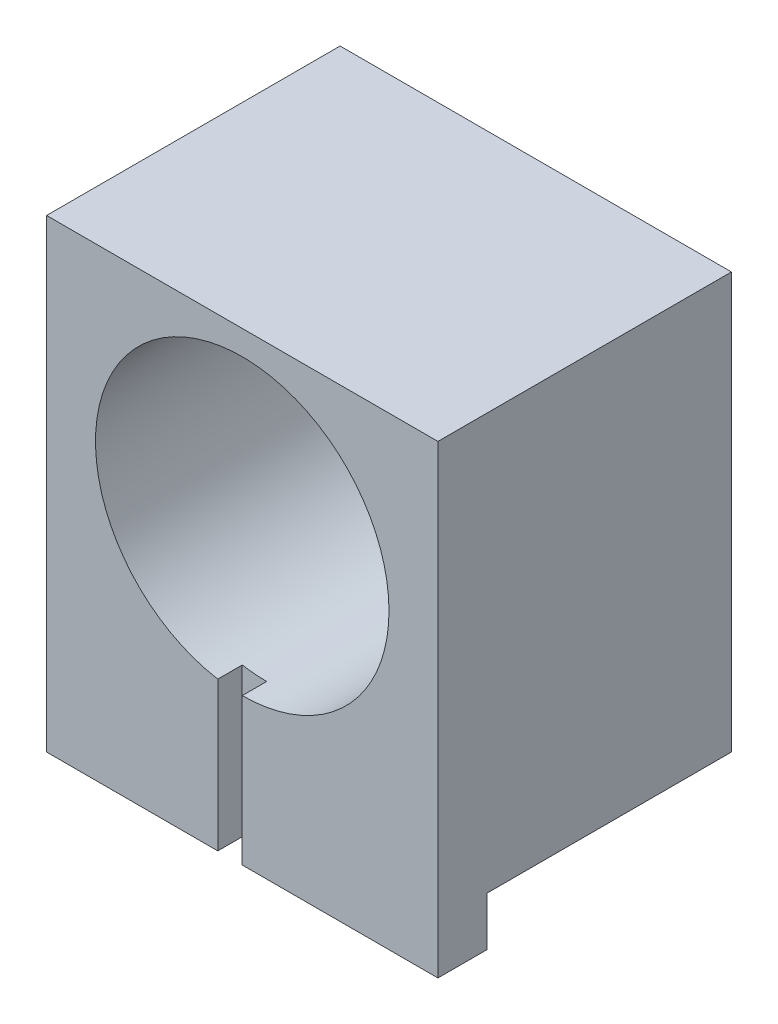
ISO-10303-21;
HEADER;
FILE_DESCRIPTION(('STEP AP214'),'2;1');
FILE_NAME('part.step','',(''),(''),'','','');
FILE_SCHEMA(('AUTOMOTIVE_DESIGN { 1 0 10303 214 1 1 1 1 }'));
ENDSEC;
DATA;
#1=APPLICATION_CONTEXT('core data for automotive mechanical design processes');
#2=APPLICATION_PROTOCOL_DEFINITION('international standard','automotive_design',2000,#1);
#3=PRODUCT_CONTEXT('',#1,'mechanical');
#4=PRODUCT('Part','Part','',(#3));
#5=PRODUCT_RELATED_PRODUCT_CATEGORY('part','',(#4));
#6=PRODUCT_DEFINITION_FORMATION('','',#4);
#7=PRODUCT_DEFINITION_CONTEXT('part definition',#1,'design');
#8=PRODUCT_DEFINITION('design','',#6,#7);
#9=PRODUCT_DEFINITION_SHAPE('','',#8);
#10=(LENGTH_UNIT() NAMED_UNIT(*) SI_UNIT(.MILLI.,.METRE.));
#11=(NAMED_UNIT(*) PLANE_ANGLE_UNIT() SI_UNIT($,.RADIAN.));
#12=(NAMED_UNIT(*) SI_UNIT($,.STERADIAN.) SOLID_ANGLE_UNIT());
#13=UNCERTAINTY_MEASURE_WITH_UNIT(LENGTH_MEASURE(1.E-05),#10,'distance_accuracy_value','');
#14=(GEOMETRIC_REPRESENTATION_CONTEXT(3) GLOBAL_UNCERTAINTY_ASSIGNED_CONTEXT((#13)) GLOBAL_UNIT_ASSIGNED_CONTEXT((#10,
#11,#12)) REPRESENTATION_CONTEXT('',''));
#15=CARTESIAN_POINT('',(0.,0.,0.));
#16=DIRECTION('',(0.,0.,1.));
#17=DIRECTION('',(1.,0.,0.));
#18=AXIS2_PLACEMENT_3D('',#15,#16,#17);
#19=CARTESIAN_POINT('',(0.,0.,60.));
#20=DIRECTION('',(0.,1.,0.));
#21=DIRECTION('',(0.,0.,1.));
#22=AXIS2_PLACEMENT_3D('',#19,#20,#21);
#23=PLANE('',#22);
#24=DIRECTION('',(1.,0.,0.));
#25=VECTOR('',#24,1.);
#26=CARTESIAN_POINT('',(0.,0.,50.));
#27=LINE('',#26,#25);
#28=CARTESIAN_POINT('',(0.,0.,50.));
#29=VERTEX_POINT('',#28);
#30=CARTESIAN_POINT('',(80.,0.,50.));
#31=VERTEX_POINT('',#30);
#32=EDGE_CURVE('E374',#29,#31,#27,.T.);
#33=ORIENTED_EDGE('',*,*,#32,.F.);
#34=DIRECTION('',(0.,0.,-1.));
#35=VECTOR('',#34,1.);
#36=CARTESIAN_POINT('',(0.,0.,60.));
#37=LINE('',#36,#35);
#38=CARTESIAN_POINT('',(0.,0.,0.));
#39=VERTEX_POINT('',#38);
#40=EDGE_CURVE('E492',#29,#39,#37,.T.);
#41=ORIENTED_EDGE('',*,*,#40,.T.);
#42=DIRECTION('',(1.,0.,0.));
#43=VECTOR('',#42,1.);
#44=CARTESIAN_POINT('',(0.,0.,0.));
#45=LINE('',#44,#43);
#46=CARTESIAN_POINT('',(80.,0.,0.));
#47=VERTEX_POINT('',#46);
#48=EDGE_CURVE('E466',#39,#47,#45,.T.);
#49=ORIENTED_EDGE('',*,*,#48,.T.);
#50=DIRECTION('',(0.,0.,-1.));
#51=VECTOR('',#50,1.);
#52=CARTESIAN_POINT('',(80.,0.,60.));
#53=LINE('',#52,#51);
#54=EDGE_CURVE('E486',#31,#47,#53,.T.);
#55=ORIENTED_EDGE('',*,*,#54,.F.);
#56=EDGE_LOOP('',(#33,#41,#49,#55));
#57=FACE_BOUND('',#56,.T.);
#58=ADVANCED_FACE('F351',(#57),#23,.F.);
#59=CARTESIAN_POINT('',(0.,0.,60.));
#60=DIRECTION('',(1.,0.,0.));
#61=DIRECTION('',(0.,0.,-1.));
#62=AXIS2_PLACEMENT_3D('',#59,#60,#61);
#63=PLANE('',#62);
#64=DIRECTION('',(0.,-1.,0.));
#65=VECTOR('',#64,1.);
#66=CARTESIAN_POINT('',(0.,0.,0.));
#67=LINE('',#66,#65);
#68=CARTESIAN_POINT('',(0.,85.,0.));
#69=VERTEX_POINT('',#68);
#70=EDGE_CURVE('E463',#69,#39,#67,.T.);
#71=ORIENTED_EDGE('',*,*,#70,.T.);
#72=ORIENTED_EDGE('',*,*,#40,.F.);
#73=DIRECTION('',(0.,1.,0.));
#74=VECTOR('',#73,1.);
#75=CARTESIAN_POINT('',(0.,-10.,50.));
#76=LINE('',#75,#74);
#77=CARTESIAN_POINT('',(0.,-10.,50.));
#78=VERTEX_POINT('',#77);
#79=EDGE_CURVE('E454',#78,#29,#76,.T.);
#80=ORIENTED_EDGE('',*,*,#79,.F.);
#81=DIRECTION('',(0.,0.,-1.));
#82=VECTOR('',#81,1.);
#83=CARTESIAN_POINT('',(0.,-10.,60.));
#84=LINE('',#83,#82);
#85=CARTESIAN_POINT('',(0.,-10.,60.));
#86=VERTEX_POINT('',#85);
#87=EDGE_CURVE('E496',#86,#78,#84,.T.);
#88=ORIENTED_EDGE('',*,*,#87,.F.);
#89=DIRECTION('',(0.,-1.,0.));
#90=VECTOR('',#89,1.);
#91=CARTESIAN_POINT('',(0.,0.,60.));
#92=LINE('',#91,#90);
#93=CARTESIAN_POINT('',(0.,85.,60.));
#94=VERTEX_POINT('',#93);
#95=EDGE_CURVE('E473',#94,#86,#92,.T.);
#96=ORIENTED_EDGE('',*,*,#95,.F.);
#97=DIRECTION('',(0.,0.,-1.));
#98=VECTOR('',#97,1.);
#99=CARTESIAN_POINT('',(0.,85.,60.));
#100=LINE('',#99,#98);
#101=EDGE_CURVE('E480',#94,#69,#100,.T.);
#102=ORIENTED_EDGE('',*,*,#101,.T.);
#103=EDGE_LOOP('',(#71,#72,#80,#88,#96,#102));
#104=FACE_BOUND('',#103,.T.);
#105=ADVANCED_FACE('F353',(#104),#63,.F.);
#106=CARTESIAN_POINT('',(80.,0.,60.));
#107=DIRECTION('',(-1.,0.,0.));
#108=DIRECTION('',(0.,0.,1.));
#109=AXIS2_PLACEMENT_3D('',#106,#107,#108);
#110=PLANE('',#109);
#111=DIRECTION('',(0.,1.,0.));
#112=VECTOR('',#111,1.);
#113=CARTESIAN_POINT('',(80.,0.,0.));
#114=LINE('',#113,#112);
#115=CARTESIAN_POINT('',(80.,85.,0.));
#116=VERTEX_POINT('',#115);
#117=EDGE_CURVE('E469',#47,#116,#114,.T.);
#118=ORIENTED_EDGE('',*,*,#117,.T.);
#119=DIRECTION('',(0.,0.,-1.));
#120=VECTOR('',#119,1.);
#121=CARTESIAN_POINT('',(80.,85.,60.));
#122=LINE('',#121,#120);
#123=CARTESIAN_POINT('',(80.,85.,60.));
#124=VERTEX_POINT('',#123);
#125=EDGE_CURVE('E483',#124,#116,#122,.T.);
#126=ORIENTED_EDGE('',*,*,#125,.F.);
#127=DIRECTION('',(0.,1.,0.));
#128=VECTOR('',#127,1.);
#129=CARTESIAN_POINT('',(80.,0.,60.));
#130=LINE('',#129,#128);
#131=CARTESIAN_POINT('',(80.,-10.,60.));
#132=VERTEX_POINT('',#131);
#133=EDGE_CURVE('E476',#132,#124,#130,.T.);
#134=ORIENTED_EDGE('',*,*,#133,.F.);
#135=DIRECTION('',(0.,0.,1.));
#136=VECTOR('',#135,1.);
#137=CARTESIAN_POINT('',(80.,-10.,60.));
#138=LINE('',#137,#136);
#139=CARTESIAN_POINT('',(80.,-10.,50.));
#140=VERTEX_POINT('',#139);
#141=EDGE_CURVE('E449',#140,#132,#138,.T.);
#142=ORIENTED_EDGE('',*,*,#141,.F.);
#143=DIRECTION('',(0.,1.,0.));
#144=VECTOR('',#143,1.);
#145=CARTESIAN_POINT('',(80.,-10.,50.));
#146=LINE('',#145,#144);
#147=EDGE_CURVE('E450',#140,#31,#146,.T.);
#148=ORIENTED_EDGE('',*,*,#147,.T.);
#149=ORIENTED_EDGE('',*,*,#54,.T.);
#150=EDGE_LOOP('',(#118,#126,#134,#142,#148,#149));
#151=FACE_BOUND('',#150,.T.);
#152=ADVANCED_FACE('F512',(#151),#110,.F.);
#153=CARTESIAN_POINT('',(0.,85.,60.));
#154=DIRECTION('',(0.,-1.,0.));
#155=DIRECTION('',(0.,0.,-1.));
#156=AXIS2_PLACEMENT_3D('',#153,#154,#155);
#157=PLANE('',#156);
#158=DIRECTION('',(-1.,0.,0.));
#159=VECTOR('',#158,1.);
#160=CARTESIAN_POINT('',(0.,85.,0.));
#161=LINE('',#160,#159);
#162=EDGE_CURVE('E471',#116,#69,#161,.T.);
#163=ORIENTED_EDGE('',*,*,#162,.T.);
#164=ORIENTED_EDGE('',*,*,#101,.F.);
#165=DIRECTION('',(-1.,0.,0.));
#166=VECTOR('',#165,1.);
#167=CARTESIAN_POINT('',(0.,85.,60.));
#168=LINE('',#167,#166);
#169=EDGE_CURVE('E478',#124,#94,#168,.T.);
#170=ORIENTED_EDGE('',*,*,#169,.F.);
#171=ORIENTED_EDGE('',*,*,#125,.T.);
#172=EDGE_LOOP('',(#163,#164,#170,#171));
#173=FACE_BOUND('',#172,.T.);
#174=ADVANCED_FACE('F519',(#173),#157,.F.);
#175=CARTESIAN_POINT('',(0.,85.,60.));
#176=DIRECTION('',(0.,0.,-1.));
#177=DIRECTION('',(-1.,0.,0.));
#178=AXIS2_PLACEMENT_3D('',#175,#176,#177);
#179=PLANE('',#178);
#180=CARTESIAN_POINT('',(40.,50.,60.));
#181=DIRECTION('',(0.,0.,1.));
#182=DIRECTION('',(1.,0.,0.));
#183=AXIS2_PLACEMENT_3D('',#180,#181,#182);
#184=CIRCLE('',#183,30.);
#185=CARTESIAN_POINT('',(40.,20.,60.));
#186=VERTEX_POINT('',#185);
#187=CARTESIAN_POINT('',(35.,20.4196010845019,60.));
#188=VERTEX_POINT('',#187);
#189=EDGE_CURVE('E443',#186,#188,#184,.T.);
#190=ORIENTED_EDGE('',*,*,#189,.F.);
#191=DIRECTION('',(0.,1.,0.));
#192=VECTOR('',#191,1.);
#193=CARTESIAN_POINT('',(40.,50.,60.));
#194=LINE('',#193,#192);
#195=CARTESIAN_POINT('',(40.,-10.,60.));
#196=VERTEX_POINT('',#195);
#197=EDGE_CURVE('E429',#196,#186,#194,.T.);
#198=ORIENTED_EDGE('',*,*,#197,.F.);
#199=DIRECTION('',(-1.,0.,0.));
#200=VECTOR('',#199,1.);
#201=CARTESIAN_POINT('',(0.,-10.,60.));
#202=LINE('',#201,#200);
#203=EDGE_CURVE('E440',#132,#196,#202,.T.);
#204=ORIENTED_EDGE('',*,*,#203,.F.);
#205=ORIENTED_EDGE('',*,*,#133,.T.);
#206=ORIENTED_EDGE('',*,*,#169,.T.);
#207=ORIENTED_EDGE('',*,*,#95,.T.);
#208=CARTESIAN_POINT('',(35.,-10.,60.));
#209=VERTEX_POINT('',#208);
#210=EDGE_CURVE('E451',#209,#86,#202,.T.);
#211=ORIENTED_EDGE('',*,*,#210,.F.);
#212=DIRECTION('',(0.,-1.,0.));
#213=VECTOR('',#212,1.);
#214=CARTESIAN_POINT('',(35.,50.,60.));
#215=LINE('',#214,#213);
#216=EDGE_CURVE('E444',#188,#209,#215,.T.);
#217=ORIENTED_EDGE('',*,*,#216,.F.);
#218=EDGE_LOOP('',(#190,#198,#204,#205,#206,#207,#211,#217));
#219=FACE_BOUND('',#218,.T.);
#220=ADVANCED_FACE('F439',(#219),#179,.F.);
#221=CARTESIAN_POINT('',(0.,85.,0.));
#222=DIRECTION('',(0.,0.,-1.));
#223=DIRECTION('',(-1.,0.,0.));
#224=AXIS2_PLACEMENT_3D('',#221,#222,#223);
#225=PLANE('',#224);
#226=CARTESIAN_POINT('',(40.,50.,0.));
#227=DIRECTION('',(0.,0.,1.));
#228=DIRECTION('',(1.,0.,0.));
#229=AXIS2_PLACEMENT_3D('',#226,#227,#228);
#230=CIRCLE('',#229,30.);
#231=CARTESIAN_POINT('',(70.,50.,0.));
#232=VERTEX_POINT('',#231);
#233=EDGE_CURVE('E460',#232,#232,#230,.T.);
#234=ORIENTED_EDGE('',*,*,#233,.T.);
#235=EDGE_LOOP('',(#234));
#236=FACE_BOUND('',#235,.T.);
#237=ORIENTED_EDGE('',*,*,#70,.F.);
#238=ORIENTED_EDGE('',*,*,#162,.F.);
#239=ORIENTED_EDGE('',*,*,#117,.F.);
#240=ORIENTED_EDGE('',*,*,#48,.F.);
#241=EDGE_LOOP('',(#237,#238,#239,#240));
#242=FACE_BOUND('',#241,.T.);
#243=ADVANCED_FACE('F543',(#236,#242),#225,.T.);
#244=CARTESIAN_POINT('',(40.,50.,0.));
#245=DIRECTION('',(0.,0.,1.));
#246=DIRECTION('',(1.,0.,0.));
#247=AXIS2_PLACEMENT_3D('',#244,#245,#246);
#248=CYLINDRICAL_SURFACE('',#247,30.);
#249=ORIENTED_EDGE('',*,*,#233,.F.);
#250=EDGE_LOOP('',(#249));
#251=FACE_BOUND('',#250,.T.);
#252=CARTESIAN_POINT('',(40.,50.,55.));
#253=DIRECTION('',(0.,0.,-1.));
#254=DIRECTION('',(-1.,0.,0.));
#255=AXIS2_PLACEMENT_3D('',#252,#253,#254);
#256=CIRCLE('',#255,30.);
#257=CARTESIAN_POINT('',(35.,20.4196010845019,55.));
#258=VERTEX_POINT('',#257);
#259=CARTESIAN_POINT('',(40.,20.,55.));
#260=VERTEX_POINT('',#259);
#261=EDGE_CURVE('E534',#258,#260,#256,.F.);
#262=ORIENTED_EDGE('',*,*,#261,.T.);
#263=DIRECTION('',(0.,0.,1.));
#264=VECTOR('',#263,1.);
#265=CARTESIAN_POINT('',(40.,20.,0.));
#266=LINE('',#265,#264);
#267=EDGE_CURVE('E497',#260,#186,#266,.T.);
#268=ORIENTED_EDGE('',*,*,#267,.T.);
#269=ORIENTED_EDGE('',*,*,#189,.T.);
#270=DIRECTION('',(0.,0.,1.));
#271=VECTOR('',#270,1.);
#272=CARTESIAN_POINT('',(35.,20.4196010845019,0.));
#273=LINE('',#272,#271);
#274=EDGE_CURVE('E538',#188,#258,#273,.F.);
#275=ORIENTED_EDGE('',*,*,#274,.T.);
#276=EDGE_LOOP('',(#262,#268,#269,#275));
#277=FACE_BOUND('',#276,.T.);
#278=ADVANCED_FACE('F537',(#251,#277),#248,.F.);
#279=CARTESIAN_POINT('',(0.,-10.,50.));
#280=DIRECTION('',(0.,0.,1.));
#281=DIRECTION('',(1.,0.,0.));
#282=AXIS2_PLACEMENT_3D('',#279,#280,#281);
#283=PLANE('',#282);
#284=ORIENTED_EDGE('',*,*,#32,.T.);
#285=ORIENTED_EDGE('',*,*,#147,.F.);
#286=DIRECTION('',(1.,0.,0.));
#287=VECTOR('',#286,1.);
#288=CARTESIAN_POINT('',(0.,-10.,50.));
#289=LINE('',#288,#287);
#290=EDGE_CURVE('E504',#78,#140,#289,.T.);
#291=ORIENTED_EDGE('',*,*,#290,.F.);
#292=ORIENTED_EDGE('',*,*,#79,.T.);
#293=EDGE_LOOP('',(#284,#285,#291,#292));
#294=FACE_BOUND('',#293,.T.);
#295=ADVANCED_FACE('F510',(#294),#283,.F.);
#296=CARTESIAN_POINT('',(0.,-10.,50.));
#297=DIRECTION('',(0.,-1.,0.));
#298=DIRECTION('',(0.,0.,-1.));
#299=AXIS2_PLACEMENT_3D('',#296,#297,#298);
#300=PLANE('',#299);
#301=DIRECTION('',(0.,0.,1.));
#302=VECTOR('',#301,1.);
#303=CARTESIAN_POINT('',(40.,-10.,50.));
#304=LINE('',#303,#302);
#305=CARTESIAN_POINT('',(40.,-10.,55.));
#306=VERTEX_POINT('',#305);
#307=EDGE_CURVE('E11',#306,#196,#304,.T.);
#308=ORIENTED_EDGE('',*,*,#307,.F.);
#309=DIRECTION('',(1.,0.,0.));
#310=VECTOR('',#309,1.);
#311=CARTESIAN_POINT('',(0.,-10.,55.));
#312=LINE('',#311,#310);
#313=CARTESIAN_POINT('',(35.,-10.,55.));
#314=VERTEX_POINT('',#313);
#315=EDGE_CURVE('E494',#314,#306,#312,.T.);
#316=ORIENTED_EDGE('',*,*,#315,.F.);
#317=DIRECTION('',(0.,0.,-1.));
#318=VECTOR('',#317,1.);
#319=CARTESIAN_POINT('',(35.,-10.,50.));
#320=LINE('',#319,#318);
#321=EDGE_CURVE('E359',#209,#314,#320,.T.);
#322=ORIENTED_EDGE('',*,*,#321,.F.);
#323=ORIENTED_EDGE('',*,*,#210,.T.);
#324=ORIENTED_EDGE('',*,*,#87,.T.);
#325=ORIENTED_EDGE('',*,*,#290,.T.);
#326=ORIENTED_EDGE('',*,*,#141,.T.);
#327=ORIENTED_EDGE('',*,*,#203,.T.);
#328=EDGE_LOOP('',(#308,#316,#322,#323,#324,#325,#326,#327));
#329=FACE_BOUND('',#328,.T.);
#330=ADVANCED_FACE('F447',(#329),#300,.T.);
#331=CARTESIAN_POINT('',(40.,50.,55.));
#332=DIRECTION('',(1.,0.,0.));
#333=DIRECTION('',(0.,1.,0.));
#334=AXIS2_PLACEMENT_3D('',#331,#332,#333);
#335=PLANE('',#334);
#336=DIRECTION('',(0.,1.,0.));
#337=VECTOR('',#336,1.);
#338=CARTESIAN_POINT('',(40.,50.,55.));
#339=LINE('',#338,#337);
#340=EDGE_CURVE('E432',#306,#260,#339,.T.);
#341=ORIENTED_EDGE('',*,*,#340,.F.);
#342=ORIENTED_EDGE('',*,*,#307,.T.);
#343=ORIENTED_EDGE('',*,*,#197,.T.);
#344=ORIENTED_EDGE('',*,*,#267,.F.);
#345=EDGE_LOOP('',(#341,#342,#343,#344));
#346=FACE_BOUND('',#345,.T.);
#347=ADVANCED_FACE('F428',(#346),#335,.F.);
#348=CARTESIAN_POINT('',(35.,50.,55.));
#349=DIRECTION('',(-1.,0.,0.));
#350=DIRECTION('',(0.,-1.,0.));
#351=AXIS2_PLACEMENT_3D('',#348,#349,#350);
#352=PLANE('',#351);
#353=ORIENTED_EDGE('',*,*,#216,.T.);
#354=ORIENTED_EDGE('',*,*,#321,.T.);
#355=DIRECTION('',(0.,-1.,0.));
#356=VECTOR('',#355,1.);
#357=CARTESIAN_POINT('',(35.,50.,55.));
#358=LINE('',#357,#356);
#359=EDGE_CURVE('E366',#258,#314,#358,.T.);
#360=ORIENTED_EDGE('',*,*,#359,.F.);
#361=ORIENTED_EDGE('',*,*,#274,.F.);
#362=EDGE_LOOP('',(#353,#354,#360,#361));
#363=FACE_BOUND('',#362,.T.);
#364=ADVANCED_FACE('F530',(#363),#352,.F.);
#365=CARTESIAN_POINT('',(40.,50.,55.));
#366=DIRECTION('',(0.,0.,-1.));
#367=DIRECTION('',(-1.,0.,0.));
#368=AXIS2_PLACEMENT_3D('',#365,#366,#367);
#369=PLANE('',#368);
#370=ORIENTED_EDGE('',*,*,#359,.T.);
#371=ORIENTED_EDGE('',*,*,#315,.T.);
#372=ORIENTED_EDGE('',*,*,#340,.T.);
#373=ORIENTED_EDGE('',*,*,#261,.F.);
#374=EDGE_LOOP('',(#370,#371,#372,#373));
#375=FACE_BOUND('',#374,.T.);
#376=ADVANCED_FACE('F532',(#375),#369,.F.);
#377=CLOSED_SHELL('',(#58,#105,#152,#174,#220,#243,#278,#295,#330,#347,#364,#376));
#378=MANIFOLD_SOLID_BREP('B2',#377);
#379=ADVANCED_BREP_SHAPE_REPRESENTATION('',(#18,#378),#14);
#380=SHAPE_DEFINITION_REPRESENTATION(#9,#379);
ENDSEC;
END-ISO-10303-21;
